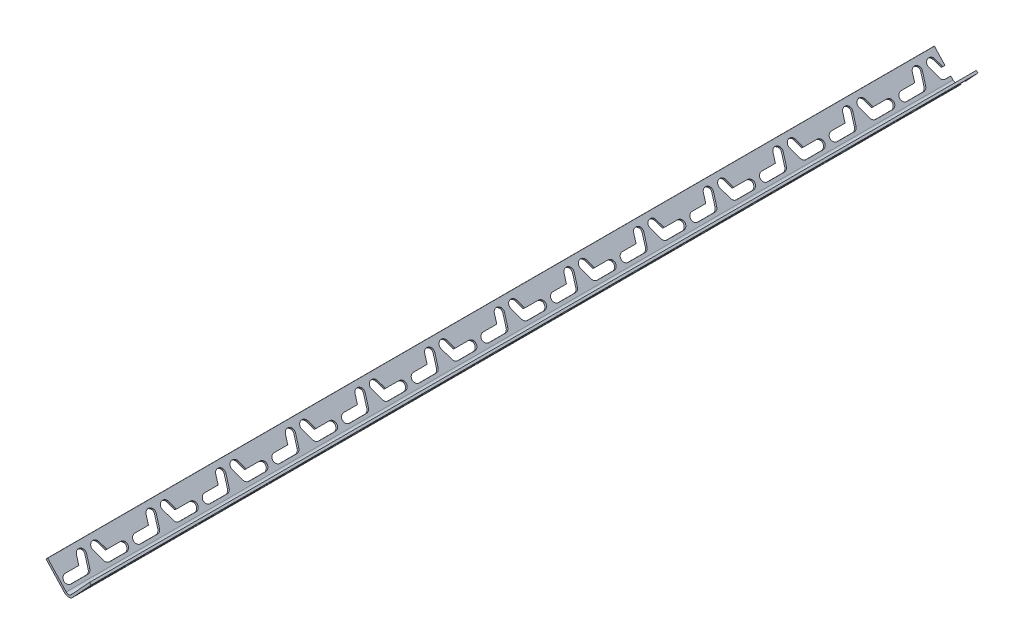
from build123d import *

# Parameters (mm, degrees)
EXTRUSION1_DEPTH        = 800
ENL_V_MAT_EXTRU_1_DEPTH = 10
ENL_V_MAT_EXTRU_2_DEPTH = 10


with BuildPart() as part:
    # Esquisse1 → Extrusion1 (new body)
    with BuildSketch(Plane.XY):
        with BuildLine():
            Line((-20.392970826, 14.647404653), (-3.667146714, -3.398828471))
            ThreePointArc((-3.667146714, -3.398828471), (0, -5), (3.667146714, -3.398828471))
            Line((3.667146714, -3.398828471), (20.392970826, 14.647404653))
            Line((20.392970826, 14.647404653), (18.926112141, 16.006936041))
            Line((18.926112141, 16.006936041), (2.200288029, -2.039297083))
            ThreePointArc((2.200288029, -2.039297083), (0, -3), (-2.200288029, -2.039297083))
            Line((-2.200288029, -2.039297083), (-18.926112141, 16.006936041))
            Line((-18.926112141, 16.006936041), (-20.392970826, 14.647404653))
        make_face()
    extrude(amount=EXTRUSION1_DEPTH)

    # Esquisse2 → Enl_v. mat.-Extru.1 (cut)
    with BuildSketch(Plane(origin=(-2.200288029, -2.039297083, 0), x_dir=(0, 0, -1), z_dir=(0.7334293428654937, 0.6797656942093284, 0))):
        with BuildLine():
            Line((-793.665118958, 2.829851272), (-778.665118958, 2.829851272))
            ThreePointArc((-778.665118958, 2.829851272), (-776.440502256, 3.531270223), (-775.02052032, 5.381826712))
            Line((-775.02052032, 5.381826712), (-771.600318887, 14.77875292))
            ThreePointArc((-771.600318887, 14.77875292), (-773.918392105, 19.749876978), (-778.889516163, 17.43180376))
            Line((-778.889516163, 17.43180376), (-781.380874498, 10.586852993))
            Line((-781.380874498, 10.586852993), (-793.665118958, 10.586852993))
            ThreePointArc((-793.665118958, 10.586852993), (-797.543619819, 6.708352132), (-793.665118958, 2.829851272))
        make_face()
        with BuildLine():
            Line((-765.889516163, 14.77875292), (-762.46931473, 5.381826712))
            ThreePointArc((-762.46931473, 5.381826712), (-761.049332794, 3.531270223), (-758.824716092, 2.829851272))
            Line((-758.824716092, 2.829851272), (-743.824716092, 2.829851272))
            ThreePointArc((-743.824716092, 2.829851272), (-739.946215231, 6.708352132), (-743.824716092, 10.586852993))
            Line((-743.824716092, 10.586852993), (-756.108960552, 10.586852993))
            Line((-756.108960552, 10.586852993), (-758.600318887, 17.43180376))
            ThreePointArc((-758.600318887, 17.43180376), (-763.571442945, 19.749876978), (-765.889516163, 14.77875292))
        make_face()
        with BuildLine():
            Line((-730.824716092, 2.829851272), (-715.824716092, 2.829851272))
            ThreePointArc((-715.824716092, 2.829851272), (-713.60009939, 3.531270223), (-712.180117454, 5.381826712))
            Line((-712.180117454, 5.381826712), (-708.75991602, 14.77875292))
            ThreePointArc((-708.75991602, 14.77875292), (-711.077989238, 19.749876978), (-716.049113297, 17.43180376))
            Line((-716.049113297, 17.43180376), (-718.540471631, 10.586852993))
            Line((-718.540471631, 10.586852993), (-730.824716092, 10.586852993))
            ThreePointArc((-730.824716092, 10.586852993), (-734.703216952, 6.708352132), (-730.824716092, 2.829851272))
        make_face()
        with BuildLine():
            Line((-703.049113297, 14.77875292), (-699.628911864, 5.381826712))
            ThreePointArc((-699.628911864, 5.381826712), (-698.208929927, 3.531270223), (-695.984313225, 2.829851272))
            Line((-695.984313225, 2.829851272), (-680.984313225, 2.829851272))
            ThreePointArc((-680.984313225, 2.829851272), (-677.105812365, 6.708352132), (-680.984313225, 10.586852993))
            Line((-680.984313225, 10.586852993), (-693.268557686, 10.586852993))
            Line((-693.268557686, 10.586852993), (-695.75991602, 17.43180376))
            ThreePointArc((-695.75991602, 17.43180376), (-700.731040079, 19.749876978), (-703.049113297, 14.77875292))
        make_face()
        with BuildLine():
            Line((-667.984313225, 2.829851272), (-652.984313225, 2.829851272))
            ThreePointArc((-652.984313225, 2.829851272), (-650.759696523, 3.531270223), (-649.339714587, 5.381826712))
            Line((-649.339714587, 5.381826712), (-645.919513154, 14.77875292))
            ThreePointArc((-645.919513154, 14.77875292), (-648.237586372, 19.749876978), (-653.20871043, 17.43180376))
            Line((-653.20871043, 17.43180376), (-655.700068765, 10.586852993))
            Line((-655.700068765, 10.586852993), (-667.984313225, 10.586852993))
            ThreePointArc((-667.984313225, 10.586852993), (-671.862814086, 6.708352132), (-667.984313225, 2.829851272))
        make_face()
        with BuildLine():
            Line((-640.20871043, 14.77875292), (-636.788508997, 5.381826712))
            ThreePointArc((-636.788508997, 5.381826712), (-635.368527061, 3.531270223), (-633.143910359, 2.829851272))
            Line((-633.143910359, 2.829851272), (-618.143910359, 2.829851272))
            ThreePointArc((-618.143910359, 2.829851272), (-614.265409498, 6.708352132), (-618.143910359, 10.586852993))
            Line((-618.143910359, 10.586852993), (-630.428154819, 10.586852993))
            Line((-630.428154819, 10.586852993), (-632.919513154, 17.43180376))
            ThreePointArc((-632.919513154, 17.43180376), (-637.890637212, 19.749876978), (-640.20871043, 14.77875292))
        make_face()
        with BuildLine():
            Line((-605.143910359, 2.829851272), (-590.143910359, 2.829851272))
            ThreePointArc((-590.143910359, 2.829851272), (-587.919293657, 3.531270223), (-586.499311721, 5.381826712))
            Line((-586.499311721, 5.381826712), (-583.079110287, 14.77875292))
            ThreePointArc((-583.079110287, 14.77875292), (-585.397183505, 19.749876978), (-590.368307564, 17.43180376))
            Line((-590.368307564, 17.43180376), (-592.859665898, 10.586852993))
            Line((-592.859665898, 10.586852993), (-605.143910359, 10.586852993))
            ThreePointArc((-605.143910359, 10.586852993), (-609.022411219, 6.708352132), (-605.143910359, 2.829851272))
        make_face()
        with BuildLine():
            Line((-577.368307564, 14.77875292), (-573.948106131, 5.381826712))
            ThreePointArc((-573.948106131, 5.381826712), (-572.528124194, 3.531270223), (-570.303507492, 2.829851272))
            Line((-570.303507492, 2.829851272), (-555.303507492, 2.829851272))
            ThreePointArc((-555.303507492, 2.829851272), (-551.425006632, 6.708352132), (-555.303507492, 10.586852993))
            Line((-555.303507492, 10.586852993), (-567.587751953, 10.586852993))
            Line((-567.587751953, 10.586852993), (-570.079110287, 17.43180376))
            ThreePointArc((-570.079110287, 17.43180376), (-575.050234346, 19.749876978), (-577.368307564, 14.77875292))
        make_face()
        with BuildLine():
            Line((-542.303507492, 2.829851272), (-527.303507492, 2.829851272))
            ThreePointArc((-527.303507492, 2.829851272), (-525.07889079, 3.531270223), (-523.658908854, 5.381826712))
            Line((-523.658908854, 5.381826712), (-520.238707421, 14.77875292))
            ThreePointArc((-520.238707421, 14.77875292), (-522.556780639, 19.749876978), (-527.527904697, 17.43180376))
            Line((-527.527904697, 17.43180376), (-530.019263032, 10.586852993))
            Line((-530.019263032, 10.586852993), (-542.303507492, 10.586852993))
            ThreePointArc((-542.303507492, 10.586852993), (-546.182008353, 6.708352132), (-542.303507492, 2.829851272))
        make_face()
        with BuildLine():
            Line((-514.527904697, 14.77875292), (-511.107703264, 5.381826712))
            ThreePointArc((-511.107703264, 5.381826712), (-509.687721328, 3.531270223), (-507.463104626, 2.829851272))
            Line((-507.463104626, 2.829851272), (-492.463104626, 2.829851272))
            ThreePointArc((-492.463104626, 2.829851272), (-488.584603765, 6.708352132), (-492.463104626, 10.586852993))
            Line((-492.463104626, 10.586852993), (-504.747349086, 10.586852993))
            Line((-504.747349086, 10.586852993), (-507.238707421, 17.43180376))
            ThreePointArc((-507.238707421, 17.43180376), (-512.209831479, 19.749876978), (-514.527904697, 14.77875292))
        make_face()
        with BuildLine():
            Line((-479.463104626, 2.829851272), (-464.463104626, 2.829851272))
            ThreePointArc((-464.463104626, 2.829851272), (-462.238487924, 3.531270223), (-460.818505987, 5.381826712))
            Line((-460.818505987, 5.381826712), (-457.398304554, 14.77875292))
            ThreePointArc((-457.398304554, 14.77875292), (-459.716377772, 19.749876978), (-464.687501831, 17.43180376))
            Line((-464.687501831, 17.43180376), (-467.178860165, 10.586852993))
            Line((-467.178860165, 10.586852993), (-479.463104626, 10.586852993))
            ThreePointArc((-479.463104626, 10.586852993), (-483.341605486, 6.708352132), (-479.463104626, 2.829851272))
        make_face()
        with BuildLine():
            Line((-451.687501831, 14.77875292), (-448.267300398, 5.381826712))
            ThreePointArc((-448.267300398, 5.381826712), (-446.847318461, 3.531270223), (-444.622701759, 2.829851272))
            Line((-444.622701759, 2.829851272), (-429.622701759, 2.829851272))
            ThreePointArc((-429.622701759, 2.829851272), (-425.744200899, 6.708352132), (-429.622701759, 10.586852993))
            Line((-429.622701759, 10.586852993), (-441.90694622, 10.586852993))
            Line((-441.90694622, 10.586852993), (-444.398304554, 17.43180376))
            ThreePointArc((-444.398304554, 17.43180376), (-449.369428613, 19.749876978), (-451.687501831, 14.77875292))
        make_face()
        with BuildLine():
            Line((-416.622701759, 2.829851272), (-401.622701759, 2.829851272))
            ThreePointArc((-401.622701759, 2.829851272), (-399.398085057, 3.531270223), (-397.978103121, 5.381826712))
            Line((-397.978103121, 5.381826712), (-394.557901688, 14.77875292))
            ThreePointArc((-394.557901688, 14.77875292), (-396.875974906, 19.749876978), (-401.847098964, 17.43180376))
            Line((-401.847098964, 17.43180376), (-404.338457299, 10.586852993))
            Line((-404.338457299, 10.586852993), (-416.622701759, 10.586852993))
            ThreePointArc((-416.622701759, 10.586852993), (-420.50120262, 6.708352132), (-416.622701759, 2.829851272))
        make_face()
        with BuildLine():
            Line((-388.847098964, 14.77875292), (-385.426897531, 5.381826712))
            ThreePointArc((-385.426897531, 5.381826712), (-384.006915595, 3.531270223), (-381.782298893, 2.829851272))
            Line((-381.782298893, 2.829851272), (-366.782298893, 2.829851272))
            ThreePointArc((-366.782298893, 2.829851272), (-362.903798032, 6.708352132), (-366.782298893, 10.586852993))
            Line((-366.782298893, 10.586852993), (-379.066543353, 10.586852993))
            Line((-379.066543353, 10.586852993), (-381.557901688, 17.43180376))
            ThreePointArc((-381.557901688, 17.43180376), (-386.529025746, 19.749876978), (-388.847098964, 14.77875292))
        make_face()
        with BuildLine():
            Line((-353.782298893, 2.829851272), (-338.782298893, 2.829851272))
            ThreePointArc((-338.782298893, 2.829851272), (-336.557682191, 3.531270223), (-335.137700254, 5.381826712))
            Line((-335.137700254, 5.381826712), (-331.717498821, 14.77875292))
            ThreePointArc((-331.717498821, 14.77875292), (-334.035572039, 19.749876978), (-339.006696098, 17.43180376))
            Line((-339.006696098, 17.43180376), (-341.498054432, 10.586852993))
            Line((-341.498054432, 10.586852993), (-353.782298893, 10.586852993))
            ThreePointArc((-353.782298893, 10.586852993), (-357.660799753, 6.708352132), (-353.782298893, 2.829851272))
        make_face()
        with BuildLine():
            Line((-326.006696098, 14.77875292), (-322.586494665, 5.381826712))
            ThreePointArc((-322.586494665, 5.381826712), (-321.166512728, 3.531270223), (-318.941896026, 2.829851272))
            Line((-318.941896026, 2.829851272), (-303.941896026, 2.829851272))
            ThreePointArc((-303.941896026, 2.829851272), (-300.063395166, 6.708352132), (-303.941896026, 10.586852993))
            Line((-303.941896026, 10.586852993), (-316.226140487, 10.586852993))
            Line((-316.226140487, 10.586852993), (-318.717498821, 17.43180376))
            ThreePointArc((-318.717498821, 17.43180376), (-323.68862288, 19.749876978), (-326.006696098, 14.77875292))
        make_face()
        with BuildLine():
            Line((-290.941896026, 2.829851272), (-275.941896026, 2.829851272))
            ThreePointArc((-275.941896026, 2.829851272), (-273.717279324, 3.531270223), (-272.297297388, 5.381826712))
            Line((-272.297297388, 5.381826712), (-268.877095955, 14.77875292))
            ThreePointArc((-268.877095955, 14.77875292), (-271.195169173, 19.749876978), (-276.166293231, 17.43180376))
            Line((-276.166293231, 17.43180376), (-278.657651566, 10.586852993))
            Line((-278.657651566, 10.586852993), (-290.941896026, 10.586852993))
            ThreePointArc((-290.941896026, 10.586852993), (-294.820396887, 6.708352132), (-290.941896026, 2.829851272))
        make_face()
        with BuildLine():
            Line((-263.166293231, 14.77875292), (-259.746091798, 5.381826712))
            ThreePointArc((-259.746091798, 5.381826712), (-258.326109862, 3.531270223), (-256.10149316, 2.829851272))
            Line((-256.10149316, 2.829851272), (-241.10149316, 2.829851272))
            ThreePointArc((-241.10149316, 2.829851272), (-237.222992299, 6.708352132), (-241.10149316, 10.586852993))
            Line((-241.10149316, 10.586852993), (-253.38573762, 10.586852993))
            Line((-253.38573762, 10.586852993), (-255.877095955, 17.43180376))
            ThreePointArc((-255.877095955, 17.43180376), (-260.848220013, 19.749876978), (-263.166293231, 14.77875292))
        make_face()
        with BuildLine():
            Line((-228.10149316, 2.829851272), (-213.10149316, 2.829851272))
            ThreePointArc((-213.10149316, 2.829851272), (-210.876876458, 3.531270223), (-209.456894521, 5.381826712))
            Line((-209.456894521, 5.381826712), (-206.036693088, 14.77875292))
            ThreePointArc((-206.036693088, 14.77875292), (-208.354766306, 19.749876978), (-213.325890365, 17.43180376))
            Line((-213.325890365, 17.43180376), (-215.817248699, 10.586852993))
            Line((-215.817248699, 10.586852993), (-228.10149316, 10.586852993))
            ThreePointArc((-228.10149316, 10.586852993), (-231.97999402, 6.708352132), (-228.10149316, 2.829851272))
        make_face()
        with BuildLine():
            Line((-200.325890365, 14.77875292), (-196.905688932, 5.381826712))
            ThreePointArc((-196.905688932, 5.381826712), (-195.485706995, 3.531270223), (-193.261090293, 2.829851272))
            Line((-193.261090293, 2.829851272), (-178.261090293, 2.829851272))
            ThreePointArc((-178.261090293, 2.829851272), (-174.382589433, 6.708352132), (-178.261090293, 10.586852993))
            Line((-178.261090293, 10.586852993), (-190.545334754, 10.586852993))
            Line((-190.545334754, 10.586852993), (-193.036693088, 17.43180376))
            ThreePointArc((-193.036693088, 17.43180376), (-198.007817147, 19.749876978), (-200.325890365, 14.77875292))
        make_face()
        with BuildLine():
            Line((-165.261090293, 2.829851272), (-150.261090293, 2.829851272))
            ThreePointArc((-150.261090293, 2.829851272), (-148.036473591, 3.531270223), (-146.616491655, 5.381826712))
            Line((-146.616491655, 5.381826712), (-143.196290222, 14.77875292))
            ThreePointArc((-143.196290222, 14.77875292), (-145.51436344, 19.749876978), (-150.485487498, 17.43180376))
            Line((-150.485487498, 17.43180376), (-152.976845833, 10.586852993))
            Line((-152.976845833, 10.586852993), (-165.261090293, 10.586852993))
            ThreePointArc((-165.261090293, 10.586852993), (-169.139591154, 6.708352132), (-165.261090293, 2.829851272))
        make_face()
        with BuildLine():
            Line((-137.485487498, 14.77875292), (-134.065286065, 5.381826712))
            ThreePointArc((-134.065286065, 5.381826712), (-132.645304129, 3.531270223), (-130.420687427, 2.829851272))
            Line((-130.420687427, 2.829851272), (-115.420687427, 2.829851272))
            ThreePointArc((-115.420687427, 2.829851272), (-111.542186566, 6.708352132), (-115.420687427, 10.586852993))
            Line((-115.420687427, 10.586852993), (-127.704931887, 10.586852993))
            Line((-127.704931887, 10.586852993), (-130.196290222, 17.43180376))
            ThreePointArc((-130.196290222, 17.43180376), (-135.16741428, 19.749876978), (-137.485487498, 14.77875292))
        make_face()
        with BuildLine():
            Line((-102.420687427, 2.829851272), (-87.420687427, 2.829851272))
            ThreePointArc((-87.420687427, 2.829851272), (-85.196070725, 3.531270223), (-83.776088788, 5.381826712))
            Line((-83.776088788, 5.381826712), (-80.355887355, 14.77875292))
            ThreePointArc((-80.355887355, 14.77875292), (-82.673960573, 19.749876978), (-87.645084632, 17.43180376))
            Line((-87.645084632, 17.43180376), (-90.136442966, 10.586852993))
            Line((-90.136442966, 10.586852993), (-102.420687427, 10.586852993))
            ThreePointArc((-102.420687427, 10.586852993), (-106.299188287, 6.708352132), (-102.420687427, 2.829851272))
        make_face()
        with BuildLine():
            Line((-74.645084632, 14.77875292), (-71.224883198, 5.381826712))
            ThreePointArc((-71.224883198, 5.381826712), (-69.804901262, 3.531270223), (-67.58028456, 2.829851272))
            Line((-67.58028456, 2.829851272), (-52.58028456, 2.829851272))
            ThreePointArc((-52.58028456, 2.829851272), (-48.7017837, 6.708352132), (-52.58028456, 10.586852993))
            Line((-52.58028456, 10.586852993), (-64.864529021, 10.586852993))
            Line((-64.864529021, 10.586852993), (-67.355887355, 17.43180376))
            ThreePointArc((-67.355887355, 17.43180376), (-72.327011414, 19.749876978), (-74.645084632, 14.77875292))
        make_face()
        with BuildLine():
            Line((-39.58028456, 2.829851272), (-24.58028456, 2.829851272))
            ThreePointArc((-24.58028456, 2.829851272), (-22.355667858, 3.531270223), (-20.935685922, 5.381826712))
            Line((-20.935685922, 5.381826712), (-17.515484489, 14.77875292))
            ThreePointArc((-17.515484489, 14.77875292), (-19.833557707, 19.749876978), (-24.804681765, 17.43180376))
            Line((-24.804681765, 17.43180376), (-27.2960401, 10.586852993))
            Line((-27.2960401, 10.586852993), (-39.58028456, 10.586852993))
            ThreePointArc((-39.58028456, 10.586852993), (-43.458785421, 6.708352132), (-39.58028456, 2.829851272))
        make_face()
        with BuildLine():
            Line((-11.804681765, 14.77875292), (-8.384480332, 5.381826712))
            ThreePointArc((-8.384480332, 5.381826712), (-6.964498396, 3.531270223), (-4.739881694, 2.829851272))
            Line((-4.739881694, 2.829851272), (10.260118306, 2.829851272))
            ThreePointArc((10.260118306, 2.829851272), (14.138619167, 6.708352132), (10.260118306, 10.586852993))
            Line((10.260118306, 10.586852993), (-2.024126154, 10.586852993))
            Line((-2.024126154, 10.586852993), (-4.515484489, 17.43180376))
            ThreePointArc((-4.515484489, 17.43180376), (-9.486608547, 19.749876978), (-11.804681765, 14.77875292))
        make_face()
    extrude(amount=-ENL_V_MAT_EXTRU_1_DEPTH, mode=Mode.SUBTRACT)

    # Esquisse5 → Enl_v. mat.-Extru.2 (cut)
    with BuildSketch(Plane(origin=(2.200288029, -2.039297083, 0), x_dir=(0, 0, 1), z_dir=(-0.733429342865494, 0.6797656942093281, 0))):
        with BuildLine():
            Line((-10.91946296, 1.906951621), (4.08053704, 1.906951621))
            ThreePointArc((4.08053704, 1.906951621), (6.305153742, 2.608370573), (7.725135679, 4.458927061))
            Line((7.725135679, 4.458927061), (11.145337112, 13.855853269))
            ThreePointArc((11.145337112, 13.855853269), (8.827263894, 18.826977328), (3.856139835, 16.508904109))
            Line((3.856139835, 16.508904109), (1.364781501, 9.663953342))
            Line((1.364781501, 9.663953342), (-10.91946296, 9.663953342))
            ThreePointArc((-10.91946296, 9.663953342), (-14.79796382, 5.785452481), (-10.91946296, 1.906951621))
        make_face()
        with BuildLine():
            Line((16.856139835, 13.855853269), (20.276341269, 4.458927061))
            ThreePointArc((20.276341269, 4.458927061), (21.696323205, 2.608370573), (23.920939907, 1.906951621))
            Line((23.920939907, 1.906951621), (38.920939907, 1.906951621))
            ThreePointArc((38.920939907, 1.906951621), (42.799440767, 5.785452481), (38.920939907, 9.663953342))
            Line((38.920939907, 9.663953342), (26.636695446, 9.663953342))
            Line((26.636695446, 9.663953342), (24.145337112, 16.508904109))
            ThreePointArc((24.145337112, 16.508904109), (19.174213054, 18.826977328), (16.856139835, 13.855853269))
        make_face()
        with BuildLine():
            Line((51.920939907, 1.906951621), (66.920939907, 1.906951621))
            ThreePointArc((66.920939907, 1.906951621), (69.145556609, 2.608370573), (70.565538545, 4.458927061))
            Line((70.565538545, 4.458927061), (73.985739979, 13.855853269))
            ThreePointArc((73.985739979, 13.855853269), (71.66766676, 18.826977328), (66.696542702, 16.508904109))
            Line((66.696542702, 16.508904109), (64.205184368, 9.663953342))
            Line((64.205184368, 9.663953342), (51.920939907, 9.663953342))
            ThreePointArc((51.920939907, 9.663953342), (48.042439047, 5.785452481), (51.920939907, 1.906951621))
        make_face()
        with BuildLine():
            Line((79.696542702, 13.855853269), (83.116744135, 4.458927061))
            ThreePointArc((83.116744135, 4.458927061), (84.536726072, 2.608370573), (86.761342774, 1.906951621))
            Line((86.761342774, 1.906951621), (101.761342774, 1.906951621))
            ThreePointArc((101.761342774, 1.906951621), (105.639843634, 5.785452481), (101.761342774, 9.663953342))
            Line((101.761342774, 9.663953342), (89.477098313, 9.663953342))
            Line((89.477098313, 9.663953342), (86.985739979, 16.508904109))
            ThreePointArc((86.985739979, 16.508904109), (82.01461592, 18.826977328), (79.696542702, 13.855853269))
        make_face()
        with BuildLine():
            Line((114.761342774, 1.906951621), (129.761342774, 1.906951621))
            ThreePointArc((129.761342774, 1.906951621), (131.985959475, 2.608370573), (133.405941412, 4.458927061))
            Line((133.405941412, 4.458927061), (136.826142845, 13.855853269))
            ThreePointArc((136.826142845, 13.855853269), (134.508069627, 18.826977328), (129.536945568, 16.508904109))
            Line((129.536945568, 16.508904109), (127.045587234, 9.663953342))
            Line((127.045587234, 9.663953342), (114.761342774, 9.663953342))
            ThreePointArc((114.761342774, 9.663953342), (110.882841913, 5.785452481), (114.761342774, 1.906951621))
        make_face()
        with BuildLine():
            Line((142.536945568, 13.855853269), (145.957147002, 4.458927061))
            ThreePointArc((145.957147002, 4.458927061), (147.377128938, 2.608370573), (149.60174564, 1.906951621))
            Line((149.60174564, 1.906951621), (164.60174564, 1.906951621))
            ThreePointArc((164.60174564, 1.906951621), (168.4802465, 5.785452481), (164.60174564, 9.663953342))
            Line((164.60174564, 9.663953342), (152.317501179, 9.663953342))
            Line((152.317501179, 9.663953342), (149.826142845, 16.508904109))
            ThreePointArc((149.826142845, 16.508904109), (144.855018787, 18.826977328), (142.536945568, 13.855853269))
        make_face()
        with BuildLine():
            Line((177.60174564, 1.906951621), (192.60174564, 1.906951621))
            ThreePointArc((192.60174564, 1.906951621), (194.826362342, 2.608370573), (196.246344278, 4.458927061))
            Line((196.246344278, 4.458927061), (199.666545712, 13.855853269))
            ThreePointArc((199.666545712, 13.855853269), (197.348472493, 18.826977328), (192.377348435, 16.508904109))
            Line((192.377348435, 16.508904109), (189.885990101, 9.663953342))
            Line((189.885990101, 9.663953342), (177.60174564, 9.663953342))
            ThreePointArc((177.60174564, 9.663953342), (173.72324478, 5.785452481), (177.60174564, 1.906951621))
        make_face()
        with BuildLine():
            Line((205.377348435, 13.855853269), (208.797549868, 4.458927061))
            ThreePointArc((208.797549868, 4.458927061), (210.217531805, 2.608370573), (212.442148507, 1.906951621))
            Line((212.442148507, 1.906951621), (227.442148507, 1.906951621))
            ThreePointArc((227.442148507, 1.906951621), (231.320649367, 5.785452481), (227.442148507, 9.663953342))
            Line((227.442148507, 9.663953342), (215.157904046, 9.663953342))
            Line((215.157904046, 9.663953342), (212.666545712, 16.508904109))
            ThreePointArc((212.666545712, 16.508904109), (207.695421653, 18.826977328), (205.377348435, 13.855853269))
        make_face()
        with BuildLine():
            Line((240.442148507, 1.906951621), (255.442148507, 1.906951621))
            ThreePointArc((255.442148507, 1.906951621), (257.666765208, 2.608370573), (259.086747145, 4.458927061))
            Line((259.086747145, 4.458927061), (262.506948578, 13.855853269))
            ThreePointArc((262.506948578, 13.855853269), (260.18887536, 18.826977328), (255.217751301, 16.508904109))
            Line((255.217751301, 16.508904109), (252.726392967, 9.663953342))
            Line((252.726392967, 9.663953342), (240.442148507, 9.663953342))
            ThreePointArc((240.442148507, 9.663953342), (236.563647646, 5.785452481), (240.442148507, 1.906951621))
        make_face()
        with BuildLine():
            Line((268.217751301, 13.855853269), (271.637952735, 4.458927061))
            ThreePointArc((271.637952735, 4.458927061), (273.057934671, 2.608370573), (275.282551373, 1.906951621))
            Line((275.282551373, 1.906951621), (290.282551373, 1.906951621))
            ThreePointArc((290.282551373, 1.906951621), (294.161052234, 5.785452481), (290.282551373, 9.663953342))
            Line((290.282551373, 9.663953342), (277.998306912, 9.663953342))
            Line((277.998306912, 9.663953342), (275.506948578, 16.508904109))
            ThreePointArc((275.506948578, 16.508904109), (270.53582452, 18.826977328), (268.217751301, 13.855853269))
        make_face()
        with BuildLine():
            Line((303.282551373, 1.906951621), (318.282551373, 1.906951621))
            ThreePointArc((318.282551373, 1.906951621), (320.507168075, 2.608370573), (321.927150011, 4.458927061))
            Line((321.927150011, 4.458927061), (325.347351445, 13.855853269))
            ThreePointArc((325.347351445, 13.855853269), (323.029278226, 18.826977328), (318.058154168, 16.508904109))
            Line((318.058154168, 16.508904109), (315.566795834, 9.663953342))
            Line((315.566795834, 9.663953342), (303.282551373, 9.663953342))
            ThreePointArc((303.282551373, 9.663953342), (299.404050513, 5.785452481), (303.282551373, 1.906951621))
        make_face()
        with BuildLine():
            Line((331.058154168, 13.855853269), (334.478355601, 4.458927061))
            ThreePointArc((334.478355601, 4.458927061), (335.898337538, 2.608370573), (338.12295424, 1.906951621))
            Line((338.12295424, 1.906951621), (353.12295424, 1.906951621))
            ThreePointArc((353.12295424, 1.906951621), (357.0014551, 5.785452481), (353.12295424, 9.663953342))
            Line((353.12295424, 9.663953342), (340.838709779, 9.663953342))
            Line((340.838709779, 9.663953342), (338.347351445, 16.508904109))
            ThreePointArc((338.347351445, 16.508904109), (333.376227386, 18.826977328), (331.058154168, 13.855853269))
        make_face()
        with BuildLine():
            Line((366.12295424, 1.906951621), (381.12295424, 1.906951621))
            ThreePointArc((381.12295424, 1.906951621), (383.347570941, 2.608370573), (384.767552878, 4.458927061))
            Line((384.767552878, 4.458927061), (388.187754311, 13.855853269))
            ThreePointArc((388.187754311, 13.855853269), (385.869681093, 18.826977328), (380.898557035, 16.508904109))
            Line((380.898557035, 16.508904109), (378.4071987, 9.663953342))
            Line((378.4071987, 9.663953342), (366.12295424, 9.663953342))
            ThreePointArc((366.12295424, 9.663953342), (362.244453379, 5.785452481), (366.12295424, 1.906951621))
        make_face()
        with BuildLine():
            Line((393.898557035, 13.855853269), (397.318758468, 4.458927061))
            ThreePointArc((397.318758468, 4.458927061), (398.738740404, 2.608370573), (400.963357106, 1.906951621))
            Line((400.963357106, 1.906951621), (415.963357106, 1.906951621))
            ThreePointArc((415.963357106, 1.906951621), (419.841857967, 5.785452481), (415.963357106, 9.663953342))
            Line((415.963357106, 9.663953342), (403.679112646, 9.663953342))
            Line((403.679112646, 9.663953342), (401.187754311, 16.508904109))
            ThreePointArc((401.187754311, 16.508904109), (396.216630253, 18.826977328), (393.898557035, 13.855853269))
        make_face()
        with BuildLine():
            Line((428.963357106, 1.906951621), (443.963357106, 1.906951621))
            ThreePointArc((443.963357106, 1.906951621), (446.187973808, 2.608370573), (447.607955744, 4.458927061))
            Line((447.607955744, 4.458927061), (451.028157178, 13.855853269))
            ThreePointArc((451.028157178, 13.855853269), (448.71008396, 18.826977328), (443.738959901, 16.508904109))
            Line((443.738959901, 16.508904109), (441.247601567, 9.663953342))
            Line((441.247601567, 9.663953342), (428.963357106, 9.663953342))
            ThreePointArc((428.963357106, 9.663953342), (425.084856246, 5.785452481), (428.963357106, 1.906951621))
        make_face()
        with BuildLine():
            Line((456.738959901, 13.855853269), (460.159161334, 4.458927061))
            ThreePointArc((460.159161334, 4.458927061), (461.579143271, 2.608370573), (463.803759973, 1.906951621))
            Line((463.803759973, 1.906951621), (478.803759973, 1.906951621))
            ThreePointArc((478.803759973, 1.906951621), (482.682260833, 5.785452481), (478.803759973, 9.663953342))
            Line((478.803759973, 9.663953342), (466.519515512, 9.663953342))
            Line((466.519515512, 9.663953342), (464.028157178, 16.508904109))
            ThreePointArc((464.028157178, 16.508904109), (459.057033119, 18.826977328), (456.738959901, 13.855853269))
        make_face()
        with BuildLine():
            Line((491.803759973, 1.906951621), (506.803759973, 1.906951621))
            ThreePointArc((506.803759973, 1.906951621), (509.028376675, 2.608370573), (510.448358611, 4.458927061))
            Line((510.448358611, 4.458927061), (513.868560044, 13.855853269))
            ThreePointArc((513.868560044, 13.855853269), (511.550486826, 18.826977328), (506.579362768, 16.508904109))
            Line((506.579362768, 16.508904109), (504.088004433, 9.663953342))
            Line((504.088004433, 9.663953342), (491.803759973, 9.663953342))
            ThreePointArc((491.803759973, 9.663953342), (487.925259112, 5.785452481), (491.803759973, 1.906951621))
        make_face()
        with BuildLine():
            Line((519.579362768, 13.855853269), (522.999564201, 4.458927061))
            ThreePointArc((522.999564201, 4.458927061), (524.419546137, 2.608370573), (526.644162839, 1.906951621))
            Line((526.644162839, 1.906951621), (541.644162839, 1.906951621))
            ThreePointArc((541.644162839, 1.906951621), (545.5226637, 5.785452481), (541.644162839, 9.663953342))
            Line((541.644162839, 9.663953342), (529.359918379, 9.663953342))
            Line((529.359918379, 9.663953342), (526.868560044, 16.508904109))
            ThreePointArc((526.868560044, 16.508904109), (521.897435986, 18.826977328), (519.579362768, 13.855853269))
        make_face()
        with BuildLine():
            Line((554.644162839, 1.906951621), (569.644162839, 1.906951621))
            ThreePointArc((569.644162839, 1.906951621), (571.868779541, 2.608370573), (573.288761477, 4.458927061))
            Line((573.288761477, 4.458927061), (576.708962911, 13.855853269))
            ThreePointArc((576.708962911, 13.855853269), (574.390889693, 18.826977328), (569.419765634, 16.508904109))
            Line((569.419765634, 16.508904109), (566.9284073, 9.663953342))
            Line((566.9284073, 9.663953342), (554.644162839, 9.663953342))
            ThreePointArc((554.644162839, 9.663953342), (550.765661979, 5.785452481), (554.644162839, 1.906951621))
        make_face()
        with BuildLine():
            Line((582.419765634, 13.855853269), (585.839967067, 4.458927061))
            ThreePointArc((585.839967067, 4.458927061), (587.259949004, 2.608370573), (589.484565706, 1.906951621))
            Line((589.484565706, 1.906951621), (604.484565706, 1.906951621))
            ThreePointArc((604.484565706, 1.906951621), (608.363066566, 5.785452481), (604.484565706, 9.663953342))
            Line((604.484565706, 9.663953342), (592.200321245, 9.663953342))
            Line((592.200321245, 9.663953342), (589.708962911, 16.508904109))
            ThreePointArc((589.708962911, 16.508904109), (584.737838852, 18.826977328), (582.419765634, 13.855853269))
        make_face()
        with BuildLine():
            Line((617.484565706, 1.906951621), (632.484565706, 1.906951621))
            ThreePointArc((632.484565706, 1.906951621), (634.709182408, 2.608370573), (636.129164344, 4.458927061))
            Line((636.129164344, 4.458927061), (639.549365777, 13.855853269))
            ThreePointArc((639.549365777, 13.855853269), (637.231292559, 18.826977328), (632.260168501, 16.508904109))
            Line((632.260168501, 16.508904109), (629.768810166, 9.663953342))
            Line((629.768810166, 9.663953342), (617.484565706, 9.663953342))
            ThreePointArc((617.484565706, 9.663953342), (613.606064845, 5.785452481), (617.484565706, 1.906951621))
        make_face()
        with BuildLine():
            Line((645.260168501, 13.855853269), (648.680369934, 4.458927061))
            ThreePointArc((648.680369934, 4.458927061), (650.10035187, 2.608370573), (652.324968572, 1.906951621))
            Line((652.324968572, 1.906951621), (667.324968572, 1.906951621))
            ThreePointArc((667.324968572, 1.906951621), (671.203469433, 5.785452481), (667.324968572, 9.663953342))
            Line((667.324968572, 9.663953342), (655.040724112, 9.663953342))
            Line((655.040724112, 9.663953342), (652.549365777, 16.508904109))
            ThreePointArc((652.549365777, 16.508904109), (647.578241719, 18.826977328), (645.260168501, 13.855853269))
        make_face()
        with BuildLine():
            Line((680.324968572, 1.906951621), (695.324968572, 1.906951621))
            ThreePointArc((695.324968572, 1.906951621), (697.549585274, 2.608370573), (698.96956721, 4.458927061))
            Line((698.96956721, 4.458927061), (702.389768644, 13.855853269))
            ThreePointArc((702.389768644, 13.855853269), (700.071695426, 18.826977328), (695.100571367, 16.508904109))
            Line((695.100571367, 16.508904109), (692.609213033, 9.663953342))
            Line((692.609213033, 9.663953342), (680.324968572, 9.663953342))
            ThreePointArc((680.324968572, 9.663953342), (676.446467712, 5.785452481), (680.324968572, 1.906951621))
        make_face()
        with BuildLine():
            Line((708.100571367, 13.855853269), (711.5207728, 4.458927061))
            ThreePointArc((711.5207728, 4.458927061), (712.940754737, 2.608370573), (715.165371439, 1.906951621))
            Line((715.165371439, 1.906951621), (730.165371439, 1.906951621))
            ThreePointArc((730.165371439, 1.906951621), (734.043872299, 5.785452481), (730.165371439, 9.663953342))
            Line((730.165371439, 9.663953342), (717.881126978, 9.663953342))
            Line((717.881126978, 9.663953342), (715.389768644, 16.508904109))
            ThreePointArc((715.389768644, 16.508904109), (710.418644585, 18.826977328), (708.100571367, 13.855853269))
        make_face()
        with BuildLine():
            Line((743.165371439, 1.906951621), (758.165371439, 1.906951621))
            ThreePointArc((758.165371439, 1.906951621), (760.389988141, 2.608370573), (761.809970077, 4.458927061))
            Line((761.809970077, 4.458927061), (765.23017151, 13.855853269))
            ThreePointArc((765.23017151, 13.855853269), (762.912098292, 18.826977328), (757.940974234, 16.508904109))
            Line((757.940974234, 16.508904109), (755.449615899, 9.663953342))
            Line((755.449615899, 9.663953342), (743.165371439, 9.663953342))
            ThreePointArc((743.165371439, 9.663953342), (739.286870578, 5.785452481), (743.165371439, 1.906951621))
        make_face()
        with BuildLine():
            Line((770.940974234, 13.855853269), (774.361175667, 4.458927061))
            ThreePointArc((774.361175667, 4.458927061), (775.781157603, 2.608370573), (778.005774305, 1.906951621))
            Line((778.005774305, 1.906951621), (793.005774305, 1.906951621))
            ThreePointArc((793.005774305, 1.906951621), (796.884275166, 5.785452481), (793.005774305, 9.663953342))
            Line((793.005774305, 9.663953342), (780.721529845, 9.663953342))
            Line((780.721529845, 9.663953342), (778.23017151, 16.508904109))
            ThreePointArc((778.23017151, 16.508904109), (773.259047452, 18.826977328), (770.940974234, 13.855853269))
        make_face()
    extrude(amount=-ENL_V_MAT_EXTRU_2_DEPTH, mode=Mode.SUBTRACT)


solid = part.part
